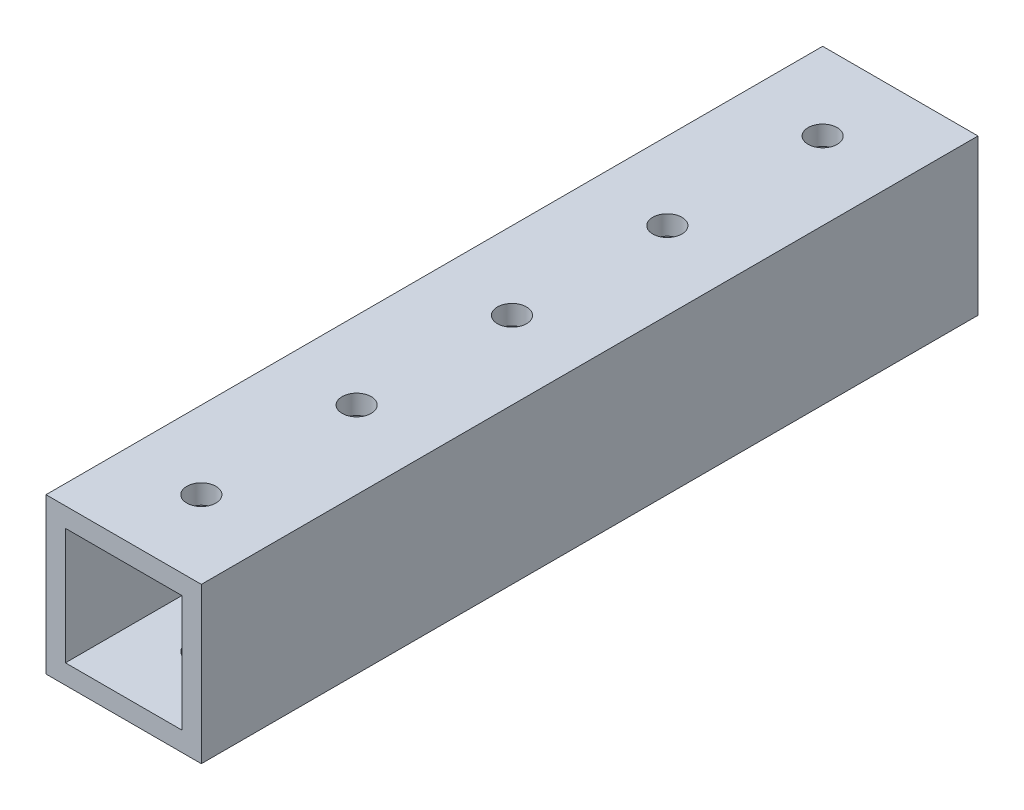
from build123d import *

# Parameters (mm, degrees)
SKETCH1_W           = 25.4
SKETCH1_H           = 25.4
SKETCH1_W_2         = 19.05
SKETCH1_H_2         = 19.05
BOSS_EXTRUDE1_DEPTH = 63.5
SKETCH2_R           = 2.38125
CUT_EXTRUDE1_DEPTH  = 70.560764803
LPATTERN1_COUNT     = 6
LPATTERN1_PITCH     = 25.4


with BuildPart() as part:
    # Sketch1 → Boss-Extrude1 (new, symmetric)
    with BuildSketch(Plane.XY):
        Rectangle(SKETCH1_W, SKETCH1_H)
        Rectangle(SKETCH1_W_2, SKETCH1_H_2, mode=Mode.SUBTRACT)
    extrude(amount=BOSS_EXTRUDE1_DEPTH, both=True)

    # Sketch2 → Cut-Extrude1 (cut, through all)
    with BuildSketch(Plane(origin=(0, 12.7, 0), x_dir=(1, 0, 0), z_dir=(0, 1, 0))):
        with Locations(Location((0, 50.8, 0), (0, 0, 270))):
            Circle(SKETCH2_R)
    cut_extrude1 = extrude(amount=-CUT_EXTRUDE1_DEPTH, mode=Mode.SUBTRACT)

    # LPattern1: Cut-Extrude1 ×6
    with Locations(*[(0, 0, i * LPATTERN1_PITCH) for i in range(1, LPATTERN1_COUNT)]):
        add(cut_extrude1, mode=Mode.SUBTRACT)


solid = part.part
